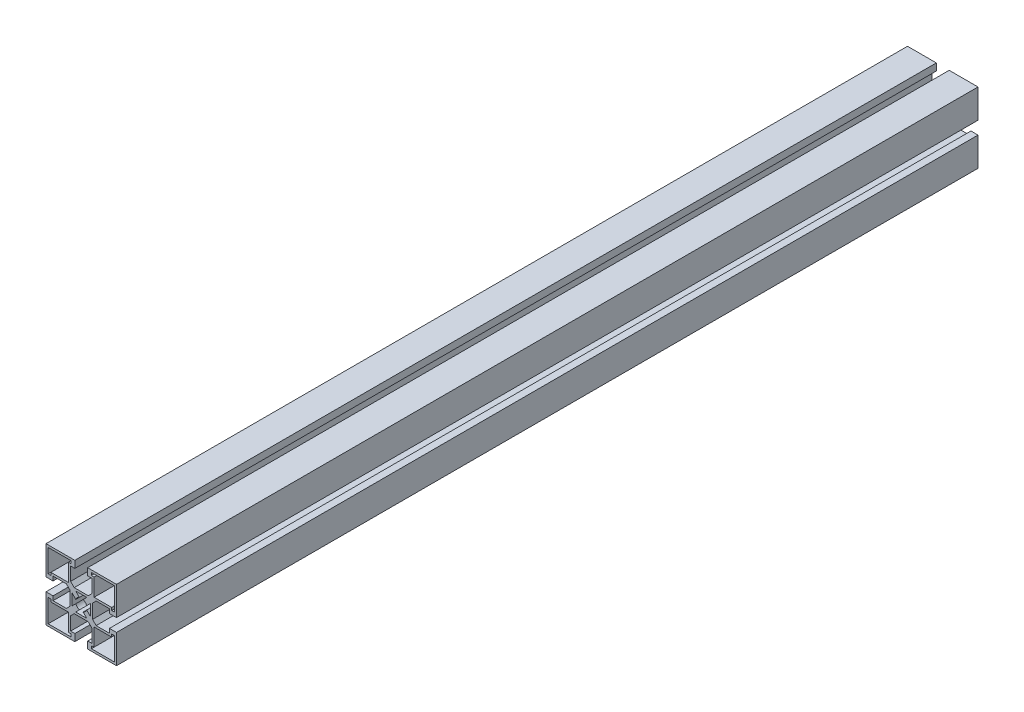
from build123d import *

# Parameters (mm, degrees)
EXTRUDE1_DEPTH = 550


with BuildPart() as part:
    # Sketch1 → Extrude1 (new body)
    with BuildSketch(Plane.XY):
        Polygon((-22.499997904, -22.500007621), (-4.099997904, -22.500007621), (-4.099997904, -18.000007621), (-6.799997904, -18.000007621), (-6.799997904, -9.500007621), (-4.499997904, -7.200007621), (4.500002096, -7.200007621), (6.800002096, -9.500007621), (6.800002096, -18.000007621), (4.100002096, -18.000007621), (4.100002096, -22.500007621), (22.500002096, -22.500007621), (22.500002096, -4.100007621), (18.000002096, -4.100007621), (18.000002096, -6.800007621), (9.500002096, -6.800007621), (7.200002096, -4.500007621), (7.200002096, 4.499992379), (9.500002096, 6.799992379), (18.000002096, 6.799992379), (18.000002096, 4.099992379), (22.500002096, 4.099992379), (22.500002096, 22.499992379), (4.100002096, 22.499992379), (4.100002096, 17.999992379), (6.800002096, 17.999992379), (6.800002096, 9.499992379), (4.500002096, 7.199992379), (-4.499997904, 7.199992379), (-6.799997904, 9.499992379), (-6.799997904, 17.999992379), (-4.099997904, 17.999992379), (-4.099997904, 22.499992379), (-22.499997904, 22.499992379), (-22.499997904, 4.099992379), (-17.999997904, 4.099992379), (-17.999997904, 6.799992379), (-9.499997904, 6.799992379), (-7.199997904, 4.499992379), (-7.199997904, -4.500007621), (-9.499997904, -6.800007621), (-17.999997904, -6.800007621), (-17.999997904, -4.100007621), (-22.499997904, -4.100007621), align=None)
        Polygon((8.200003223, 8.199980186), (8.199989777, 19.399992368), (6.500002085, 19.399992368), (6.500002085, 21.099984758), (21.100004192, 21.099984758), (21.100004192, 6.499980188), (19.400009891, 6.499980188), (19.400009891, 8.199980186), align=None, mode=Mode.SUBTRACT)
        Polygon((-19.399997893, 6.499992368), (-21.099990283, 6.499992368), (-21.099990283, 21.099994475), (-6.499974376, 21.099994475), (-6.49997587, 19.399985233), (-8.199975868, 19.399986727), (-8.199985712, 8.19998006), (-19.399997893, 8.19998006), align=None, mode=Mode.SUBTRACT)
        Polygon((-6.499997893, -21.1), (-21.1, -21.1), (-21.1, -6.499995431), (-19.400002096, -6.499995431), (-19.400002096, -8.199995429), (-8.199995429, -8.199995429), (-8.199995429, -19.40000761), (-6.499997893, -19.400009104), align=None, mode=Mode.SUBTRACT)
        Polygon((6.499989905, -19.400011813), (8.199989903, -19.400011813), (8.199989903, -8.200005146), (19.400002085, -8.200005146), (19.400003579, -6.500017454), (21.099994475, -6.500018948), (21.099994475, -21.100009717), (6.499989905, -21.100009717), align=None, mode=Mode.SUBTRACT)
        with BuildLine():
            Line((-5.799999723, 3.537265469), (-3.451121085, 1.18838683))
            ThreePointArc((-3.451121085, 1.18838683), (-2.580942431, 2.580937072), (-1.188393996, 3.451118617))
            Line((-1.188393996, 3.451118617), (-3.537277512, 5.799992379))
            Line((-3.537277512, 5.799992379), (3.537277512, 5.799992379))
            Line((3.537277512, 5.799992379), (1.188393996, 3.451118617))
            ThreePointArc((1.188393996, 3.451118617), (2.580942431, 2.580937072), (3.451121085, 1.18838683))
            Line((3.451121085, 1.18838683), (5.799999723, 3.537265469))
            Line((5.799999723, 3.537265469), (5.799985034, -3.537266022))
            Line((5.799985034, -3.537266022), (3.451117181, -1.188398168))
            ThreePointArc((3.451117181, -1.188398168), (2.580938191, -2.580941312), (1.188393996, -3.451118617))
            Line((1.188393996, -3.451118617), (3.537277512, -5.799992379))
            Line((3.537277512, -5.799992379), (-3.537277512, -5.799992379))
            Line((-3.537277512, -5.799992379), (-1.188393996, -3.451118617))
            ThreePointArc((-1.188393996, -3.451118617), (-2.580938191, -2.580941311), (-3.451117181, -1.188398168))
            Line((-3.451117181, -1.188398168), (-5.799985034, -3.537266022))
            Line((-5.799985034, -3.537266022), (-5.799999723, 3.537265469))
        make_face(mode=Mode.SUBTRACT)
    extrude(amount=EXTRUDE1_DEPTH)


solid = part.part
